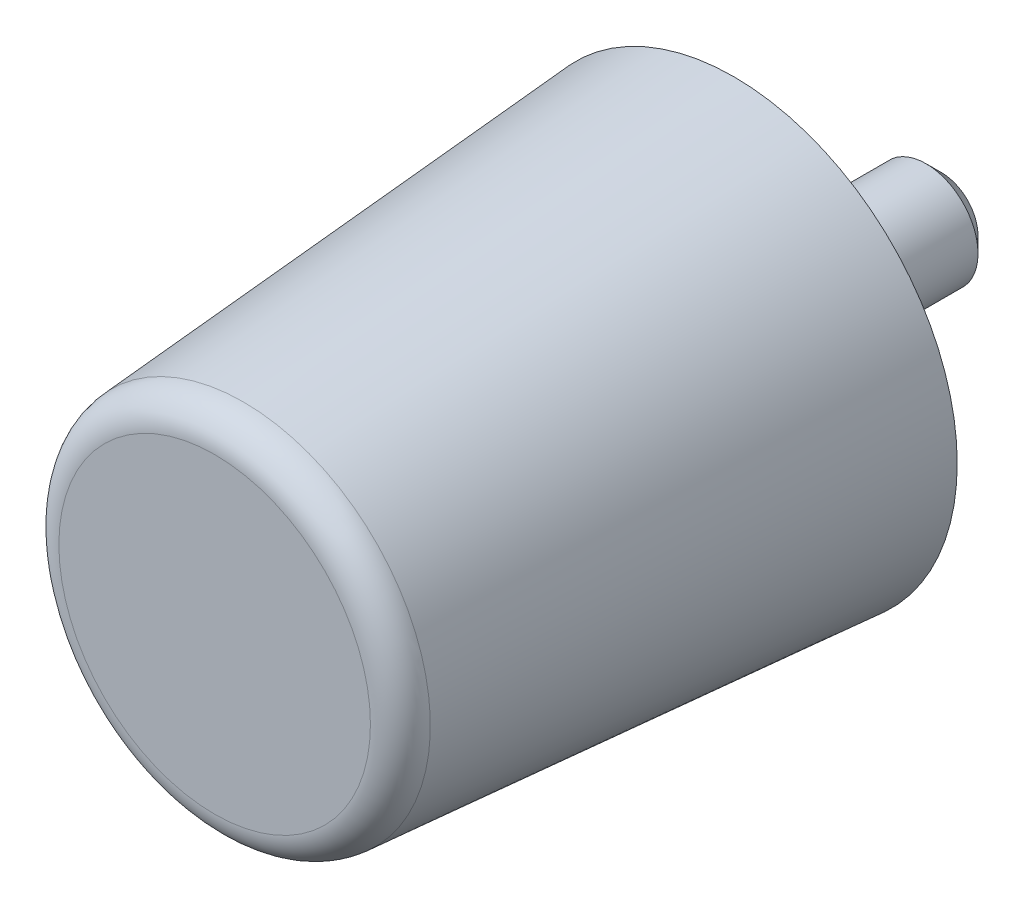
ISO-10303-21;
HEADER;
FILE_DESCRIPTION(('STEP AP214'),'2;1');
FILE_NAME('part.step','',(''),(''),'','','');
FILE_SCHEMA(('AUTOMOTIVE_DESIGN { 1 0 10303 214 1 1 1 1 }'));
ENDSEC;
DATA;
#1=APPLICATION_CONTEXT('core data for automotive mechanical design processes');
#2=APPLICATION_PROTOCOL_DEFINITION('international standard','automotive_design',2000,#1);
#3=PRODUCT_CONTEXT('',#1,'mechanical');
#4=PRODUCT('Part','Part','',(#3));
#5=PRODUCT_RELATED_PRODUCT_CATEGORY('part','',(#4));
#6=PRODUCT_DEFINITION_FORMATION('','',#4);
#7=PRODUCT_DEFINITION_CONTEXT('part definition',#1,'design');
#8=PRODUCT_DEFINITION('design','',#6,#7);
#9=PRODUCT_DEFINITION_SHAPE('','',#8);
#10=(LENGTH_UNIT() NAMED_UNIT(*) SI_UNIT(.MILLI.,.METRE.));
#11=(NAMED_UNIT(*) PLANE_ANGLE_UNIT() SI_UNIT($,.RADIAN.));
#12=(NAMED_UNIT(*) SI_UNIT($,.STERADIAN.) SOLID_ANGLE_UNIT());
#13=UNCERTAINTY_MEASURE_WITH_UNIT(LENGTH_MEASURE(1.E-05),#10,'distance_accuracy_value','');
#14=(GEOMETRIC_REPRESENTATION_CONTEXT(3) GLOBAL_UNCERTAINTY_ASSIGNED_CONTEXT((#13)) GLOBAL_UNIT_ASSIGNED_CONTEXT((#10,
#11,#12)) REPRESENTATION_CONTEXT('',''));
#15=CARTESIAN_POINT('',(0.,0.,0.));
#16=DIRECTION('',(0.,0.,1.));
#17=DIRECTION('',(1.,0.,0.));
#18=AXIS2_PLACEMENT_3D('',#15,#16,#17);
#19=CARTESIAN_POINT('',(0.,0.,50.));
#20=DIRECTION('',(0.,0.,1.));
#21=DIRECTION('',(0.,-1.,0.));
#22=AXIS2_PLACEMENT_3D('',#19,#20,#21);
#23=CYLINDRICAL_SURFACE('',#22,19.35);
#24=CARTESIAN_POINT('',(0.,0.,0.));
#25=DIRECTION('',(0.,0.,1.));
#26=DIRECTION('',(0.,-1.,0.));
#27=AXIS2_PLACEMENT_3D('',#24,#25,#26);
#28=CIRCLE('',#27,19.35);
#29=CARTESIAN_POINT('',(0.,-19.35,0.));
#30=VERTEX_POINT('',#29);
#31=EDGE_CURVE('E27',#30,#30,#28,.T.);
#32=ORIENTED_EDGE('',*,*,#31,.F.);
#33=EDGE_LOOP('',(#32));
#34=FACE_BOUND('',#33,.T.);
#35=CARTESIAN_POINT('',(0.,0.,0.0500000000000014));
#36=DIRECTION('',(0.,0.,1.));
#37=DIRECTION('',(0.,-1.,0.));
#38=AXIS2_PLACEMENT_3D('',#35,#36,#37);
#39=CIRCLE('',#38,19.35);
#40=CARTESIAN_POINT('',(0.,-19.35,0.0500000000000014));
#41=VERTEX_POINT('',#40);
#42=EDGE_CURVE('E44',#41,#41,#39,.T.);
#43=ORIENTED_EDGE('',*,*,#42,.T.);
#44=EDGE_LOOP('',(#43));
#45=FACE_BOUND('',#44,.T.);
#46=ADVANCED_FACE('F12',(#34,#45),#23,.F.);
#47=CARTESIAN_POINT('',(19.35,0.,0.));
#48=DIRECTION('',(0.,0.,1.));
#49=DIRECTION('',(0.,-1.,0.));
#50=AXIS2_PLACEMENT_3D('',#47,#48,#49);
#51=PLANE('',#50);
#52=CARTESIAN_POINT('',(0.,0.,0.));
#53=DIRECTION('',(0.,0.,1.));
#54=DIRECTION('',(0.,-1.,0.));
#55=AXIS2_PLACEMENT_3D('',#52,#53,#54);
#56=CIRCLE('',#55,21.5);
#57=CARTESIAN_POINT('',(0.,-21.5,0.));
#58=VERTEX_POINT('',#57);
#59=EDGE_CURVE('E32',#58,#58,#56,.T.);
#60=ORIENTED_EDGE('',*,*,#59,.F.);
#61=EDGE_LOOP('',(#60));
#62=FACE_BOUND('',#61,.T.);
#63=ORIENTED_EDGE('',*,*,#31,.T.);
#64=EDGE_LOOP('',(#63));
#65=FACE_BOUND('',#64,.T.);
#66=ADVANCED_FACE('F72',(#62,#65),#51,.F.);
#67=CARTESIAN_POINT('',(0.,0.,0.));
#68=DIRECTION('',(0.,0.,-1.));
#69=DIRECTION('',(0.,1.,0.));
#70=AXIS2_PLACEMENT_3D('',#67,#68,#69);
#71=CONICAL_SURFACE('',#70,21.5,0.0741559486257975);
#72=CARTESIAN_POINT('',(0.,0.,47.2222640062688));
#73=DIRECTION('',(0.,0.,1.));
#74=DIRECTION('',(0.,-1.,0.));
#75=AXIS2_PLACEMENT_3D('',#72,#73,#74);
#76=CIRCLE('',#75,17.9917551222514);
#77=CARTESIAN_POINT('',(0.,-17.9917551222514,47.2222640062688));
#78=VERTEX_POINT('',#77);
#79=EDGE_CURVE('E35',#78,#78,#76,.T.);
#80=ORIENTED_EDGE('',*,*,#79,.F.);
#81=EDGE_LOOP('',(#80));
#82=FACE_BOUND('',#81,.T.);
#83=ORIENTED_EDGE('',*,*,#59,.T.);
#84=EDGE_LOOP('',(#83));
#85=FACE_BOUND('',#84,.T.);
#86=ADVANCED_FACE('F77',(#82,#85),#71,.T.);
#87=CARTESIAN_POINT('',(0.,0.,47.));
#88=DIRECTION('',(0.,0.,1.));
#89=DIRECTION('',(0.,-1.,0.));
#90=AXIS2_PLACEMENT_3D('',#87,#88,#89);
#91=TOROIDAL_SURFACE('',#90,15.,3.);
#92=ORIENTED_EDGE('',*,*,#79,.T.);
#93=EDGE_LOOP('',(#92));
#94=FACE_BOUND('',#93,.T.);
#95=CARTESIAN_POINT('',(0.,0.,50.));
#96=DIRECTION('',(0.,0.,1.));
#97=DIRECTION('',(0.,-1.,0.));
#98=AXIS2_PLACEMENT_3D('',#95,#96,#97);
#99=CIRCLE('',#98,15.);
#100=CARTESIAN_POINT('',(0.,-15.,50.));
#101=VERTEX_POINT('',#100);
#102=EDGE_CURVE('E38',#101,#101,#99,.T.);
#103=ORIENTED_EDGE('',*,*,#102,.F.);
#104=EDGE_LOOP('',(#103));
#105=FACE_BOUND('',#104,.T.);
#106=ADVANCED_FACE('F84',(#94,#105),#91,.T.);
#107=CARTESIAN_POINT('',(15.,0.,50.));
#108=DIRECTION('',(0.,0.,-1.));
#109=DIRECTION('',(0.,1.,0.));
#110=AXIS2_PLACEMENT_3D('',#107,#108,#109);
#111=PLANE('',#110);
#112=ORIENTED_EDGE('',*,*,#102,.T.);
#113=EDGE_LOOP('',(#112));
#114=FACE_BOUND('',#113,.T.);
#115=ADVANCED_FACE('F59',(#114),#111,.F.);
#116=CARTESIAN_POINT('',(0.,0.,0.));
#117=DIRECTION('',(0.,0.,1.));
#118=DIRECTION('',(0.,-1.,0.));
#119=AXIS2_PLACEMENT_3D('',#116,#117,#118);
#120=PLANE('',#119);
#121=CARTESIAN_POINT('',(0.,0.,0.));
#122=DIRECTION('',(0.,0.,1.));
#123=DIRECTION('',(0.,-1.,0.));
#124=AXIS2_PLACEMENT_3D('',#121,#122,#123);
#125=CIRCLE('',#124,19.3);
#126=CARTESIAN_POINT('',(0.,-19.3,0.));
#127=VERTEX_POINT('',#126);
#128=EDGE_CURVE('E41',#127,#127,#125,.T.);
#129=ORIENTED_EDGE('',*,*,#128,.F.);
#130=EDGE_LOOP('',(#129));
#131=FACE_BOUND('',#130,.T.);
#132=CARTESIAN_POINT('',(0.,0.,0.));
#133=DIRECTION('',(0.,0.,1.));
#134=DIRECTION('',(0.,-1.,0.));
#135=AXIS2_PLACEMENT_3D('',#132,#133,#134);
#136=CIRCLE('',#135,5.);
#137=CARTESIAN_POINT('',(0.,-5.,0.));
#138=VERTEX_POINT('',#137);
#139=EDGE_CURVE('E23',#138,#138,#136,.T.);
#140=ORIENTED_EDGE('',*,*,#139,.T.);
#141=EDGE_LOOP('',(#140));
#142=FACE_BOUND('',#141,.T.);
#143=ADVANCED_FACE('F53',(#131,#142),#120,.F.);
#144=CARTESIAN_POINT('',(0.,0.,0.));
#145=DIRECTION('',(0.,0.,1.));
#146=DIRECTION('',(0.,-1.,0.));
#147=AXIS2_PLACEMENT_3D('',#144,#145,#146);
#148=CONICAL_SURFACE('',#147,19.3,0.785398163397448);
#149=ORIENTED_EDGE('',*,*,#42,.F.);
#150=EDGE_LOOP('',(#149));
#151=FACE_BOUND('',#150,.T.);
#152=ORIENTED_EDGE('',*,*,#128,.T.);
#153=EDGE_LOOP('',(#152));
#154=FACE_BOUND('',#153,.T.);
#155=ADVANCED_FACE('F49',(#151,#154),#148,.T.);
#156=CARTESIAN_POINT('',(0.,0.,50.));
#157=DIRECTION('',(0.,0.,1.));
#158=DIRECTION('',(0.,-1.,0.));
#159=AXIS2_PLACEMENT_3D('',#156,#157,#158);
#160=CYLINDRICAL_SURFACE('',#159,5.);
#161=CARTESIAN_POINT('',(0.,0.,-18.5));
#162=DIRECTION('',(0.,0.,-1.));
#163=DIRECTION('',(0.,1.,0.));
#164=AXIS2_PLACEMENT_3D('',#161,#162,#163);
#165=CIRCLE('',#164,5.);
#166=CARTESIAN_POINT('',(0.,5.,-18.5));
#167=VERTEX_POINT('',#166);
#168=EDGE_CURVE('E8',#167,#167,#165,.F.);
#169=ORIENTED_EDGE('',*,*,#168,.T.);
#170=EDGE_LOOP('',(#169));
#171=FACE_BOUND('',#170,.T.);
#172=ORIENTED_EDGE('',*,*,#139,.F.);
#173=EDGE_LOOP('',(#172));
#174=FACE_BOUND('',#173,.T.);
#175=ADVANCED_FACE('F52',(#171,#174),#160,.T.);
#176=CARTESIAN_POINT('',(0.,0.,-20.));
#177=DIRECTION('',(0.,0.,-1.));
#178=DIRECTION('',(0.,1.,0.));
#179=AXIS2_PLACEMENT_3D('',#176,#177,#178);
#180=PLANE('',#179);
#181=CARTESIAN_POINT('',(0.,0.,-20.));
#182=DIRECTION('',(0.,0.,-1.));
#183=DIRECTION('',(0.,1.,0.));
#184=AXIS2_PLACEMENT_3D('',#181,#182,#183);
#185=CIRCLE('',#184,3.5);
#186=CARTESIAN_POINT('',(0.,3.5,-20.));
#187=VERTEX_POINT('',#186);
#188=EDGE_CURVE('E19',#187,#187,#185,.T.);
#189=ORIENTED_EDGE('',*,*,#188,.T.);
#190=EDGE_LOOP('',(#189));
#191=FACE_BOUND('',#190,.T.);
#192=ADVANCED_FACE('F64',(#191),#180,.T.);
#193=CARTESIAN_POINT('',(0.,0.,-20.));
#194=DIRECTION('',(0.,0.,1.));
#195=DIRECTION('',(0.,-1.,0.));
#196=AXIS2_PLACEMENT_3D('',#193,#194,#195);
#197=CONICAL_SURFACE('',#196,3.5,0.785398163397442);
#198=ORIENTED_EDGE('',*,*,#168,.F.);
#199=EDGE_LOOP('',(#198));
#200=FACE_BOUND('',#199,.T.);
#201=ORIENTED_EDGE('',*,*,#188,.F.);
#202=EDGE_LOOP('',(#201));
#203=FACE_BOUND('',#202,.T.);
#204=ADVANCED_FACE('F14',(#200,#203),#197,.T.);
#205=CLOSED_SHELL('',(#46,#66,#86,#106,#115,#143,#155,#175,#192,#204));
#206=MANIFOLD_SOLID_BREP('B1',#205);
#207=ADVANCED_BREP_SHAPE_REPRESENTATION('',(#18,#206),#14);
#208=SHAPE_DEFINITION_REPRESENTATION(#9,#207);
ENDSEC;
END-ISO-10303-21;
